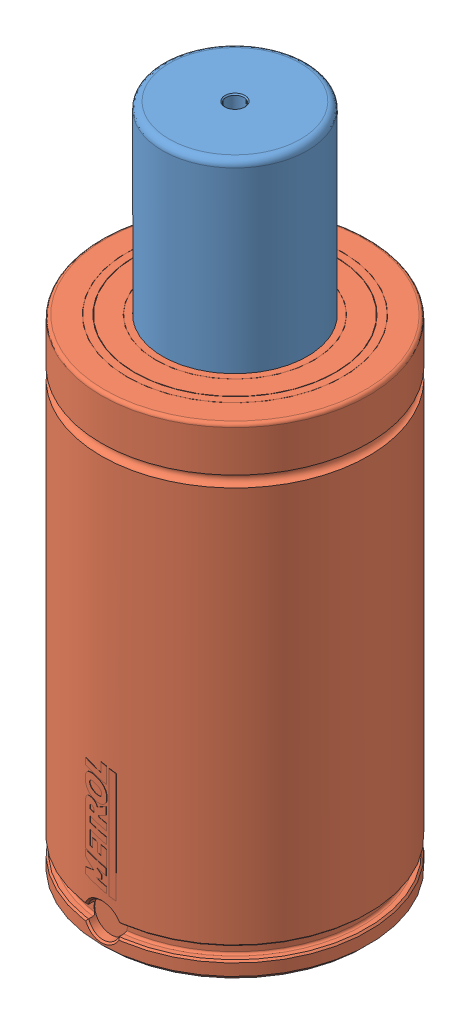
SolidWorks assembly ISNG5000-080.SLDASM, configuration Default (file format 7000). Lengths in mm.
Overall size (120 300 120.11).
2 component instances, 2 part files, 5 mates.
Components (placement in the parent):
- ISNG-5000 Piston-2: ISNG-5000 Piston.SLDPRT [ISNG-5000-80] at (0 192 0) x (-0.97228 0 0.233819) z (0 -1 0) size (85 85 108)
- ISNG-5000 Body-3: ISNG-5000 Body.SLDPRT [ISNG-5000-80] x (0 0 1) z (0 -1 0) size (120.11 120 217)
Mates (geometry in assembly coordinates):
- Concentric1: concentric aligned: cylinder of ISNG-5000 Piston-2 through (0 192 0) axis (0 -1 0) radius 32.5; cylinder of ISNG-5000 Body-3 through (0 0 0) axis (0 -1 0) radius 60
- LimitDistance1: limit distance = 83 mm aligned: plane of ISNG-5000 Body-3 through (-45 217 0) normal (0 1 0); plane of ISNG-5000 Piston-2 through (-6.8977 300 -28.6823) normal (0 1 0)
- Coincident1: coincident anti-aligned: plane of ISNG-5000 Body-3 through (0 0 0) normal (0 -1 0); plane of assembly through (0 0 0) normal (0 1 0)
- Coincident3: coincident anti-aligned: plane of ISNG-5000 Body-3; plane of assembly through (0 0 0) normal (1 0 0)
- Coincident5: coincident aligned: plane of ISNG-5000 Body-3; plane of assembly through (0 0 0) normal (0 0 1)
